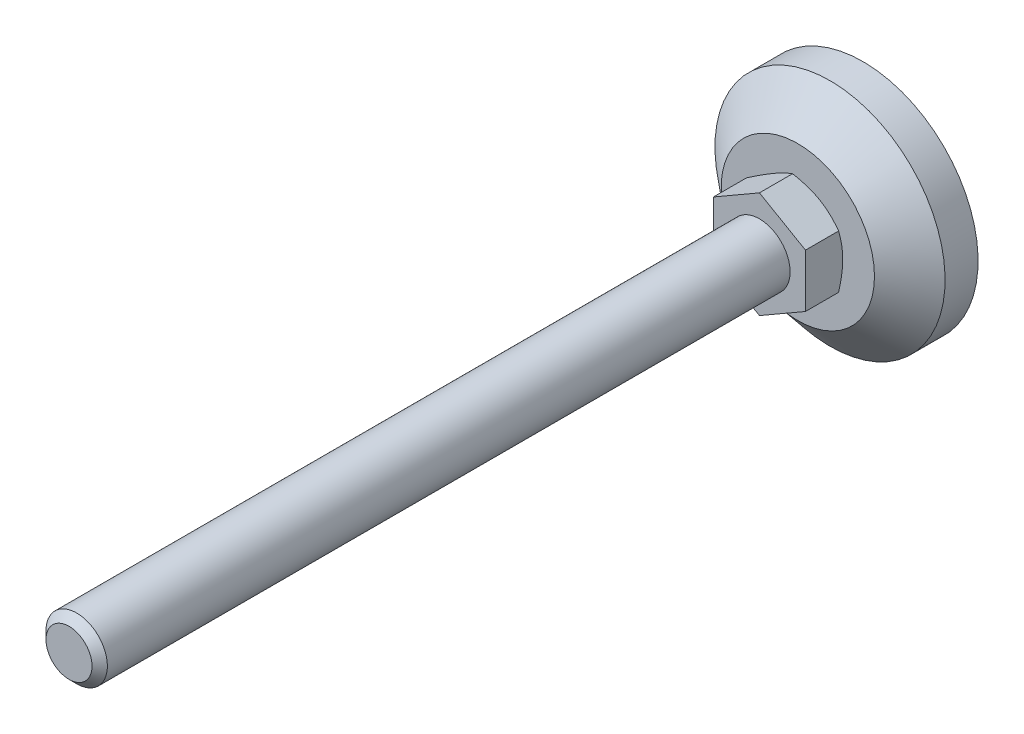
ISO-10303-21;
HEADER;
FILE_DESCRIPTION(('STEP AP214'),'2;1');
FILE_NAME('part.step','',(''),(''),'','','');
FILE_SCHEMA(('AUTOMOTIVE_DESIGN { 1 0 10303 214 1 1 1 1 }'));
ENDSEC;
DATA;
#1=APPLICATION_CONTEXT('core data for automotive mechanical design processes');
#2=APPLICATION_PROTOCOL_DEFINITION('international standard','automotive_design',2000,#1);
#3=PRODUCT_CONTEXT('',#1,'mechanical');
#4=PRODUCT('Part','Part','',(#3));
#5=PRODUCT_RELATED_PRODUCT_CATEGORY('part','',(#4));
#6=PRODUCT_DEFINITION_FORMATION('','',#4);
#7=PRODUCT_DEFINITION_CONTEXT('part definition',#1,'design');
#8=PRODUCT_DEFINITION('design','',#6,#7);
#9=PRODUCT_DEFINITION_SHAPE('','',#8);
#10=(LENGTH_UNIT() NAMED_UNIT(*) SI_UNIT(.MILLI.,.METRE.));
#11=(NAMED_UNIT(*) PLANE_ANGLE_UNIT() SI_UNIT($,.RADIAN.));
#12=(NAMED_UNIT(*) SI_UNIT($,.STERADIAN.) SOLID_ANGLE_UNIT());
#13=UNCERTAINTY_MEASURE_WITH_UNIT(LENGTH_MEASURE(1.E-05),#10,'distance_accuracy_value','');
#14=(GEOMETRIC_REPRESENTATION_CONTEXT(3) GLOBAL_UNCERTAINTY_ASSIGNED_CONTEXT((#13)) GLOBAL_UNIT_ASSIGNED_CONTEXT((#10,
#11,#12)) REPRESENTATION_CONTEXT('',''));
#15=CARTESIAN_POINT('',(0.,0.,0.));
#16=DIRECTION('',(0.,0.,1.));
#17=DIRECTION('',(1.,0.,0.));
#18=AXIS2_PLACEMENT_3D('',#15,#16,#17);
#19=CARTESIAN_POINT('',(0.,0.,27.));
#20=DIRECTION('',(0.,0.,1.));
#21=DIRECTION('',(0.5,-0.866025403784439,0.));
#22=AXIS2_PLACEMENT_3D('',#19,#20,#21);
#23=PLANE('',#22);
#24=DIRECTION('',(0.,1.,0.));
#25=VECTOR('',#24,1.);
#26=CARTESIAN_POINT('',(12.,-6.92820323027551,27.));
#27=LINE('',#26,#25);
#28=CARTESIAN_POINT('',(12.,-6.92820323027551,27.));
#29=VERTEX_POINT('',#28);
#30=CARTESIAN_POINT('',(12.,6.92820323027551,27.));
#31=VERTEX_POINT('',#30);
#32=EDGE_CURVE('E197',#29,#31,#27,.T.);
#33=ORIENTED_EDGE('',*,*,#32,.T.);
#34=DIRECTION('',(-0.866025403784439,0.5,0.));
#35=VECTOR('',#34,1.);
#36=CARTESIAN_POINT('',(12.,6.92820323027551,27.));
#37=LINE('',#36,#35);
#38=CARTESIAN_POINT('',(0.,13.856406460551,27.));
#39=VERTEX_POINT('',#38);
#40=EDGE_CURVE('E320',#31,#39,#37,.T.);
#41=ORIENTED_EDGE('',*,*,#40,.T.);
#42=DIRECTION('',(-0.866025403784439,-0.5,0.));
#43=VECTOR('',#42,1.);
#44=CARTESIAN_POINT('',(0.,13.856406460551,27.));
#45=LINE('',#44,#43);
#46=CARTESIAN_POINT('',(-12.,6.92820323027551,27.));
#47=VERTEX_POINT('',#46);
#48=EDGE_CURVE('E319',#39,#47,#45,.T.);
#49=ORIENTED_EDGE('',*,*,#48,.T.);
#50=DIRECTION('',(0.,-1.,0.));
#51=VECTOR('',#50,1.);
#52=CARTESIAN_POINT('',(-12.,6.92820323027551,27.));
#53=LINE('',#52,#51);
#54=CARTESIAN_POINT('',(-12.,-6.92820323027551,27.));
#55=VERTEX_POINT('',#54);
#56=EDGE_CURVE('E324',#47,#55,#53,.T.);
#57=ORIENTED_EDGE('',*,*,#56,.T.);
#58=DIRECTION('',(0.866025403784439,-0.5,0.));
#59=VECTOR('',#58,1.);
#60=CARTESIAN_POINT('',(-12.,-6.92820323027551,27.));
#61=LINE('',#60,#59);
#62=CARTESIAN_POINT('',(0.,-13.856406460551,27.));
#63=VERTEX_POINT('',#62);
#64=EDGE_CURVE('E326',#55,#63,#61,.T.);
#65=ORIENTED_EDGE('',*,*,#64,.T.);
#66=DIRECTION('',(0.866025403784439,0.5,0.));
#67=VECTOR('',#66,1.);
#68=CARTESIAN_POINT('',(0.,-13.856406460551,27.));
#69=LINE('',#68,#67);
#70=EDGE_CURVE('E37',#63,#29,#69,.T.);
#71=ORIENTED_EDGE('',*,*,#70,.T.);
#72=EDGE_LOOP('',(#33,#41,#49,#57,#65,#71));
#73=FACE_BOUND('',#72,.T.);
#74=CARTESIAN_POINT('',(0.,0.,27.));
#75=DIRECTION('',(0.,0.,1.));
#76=DIRECTION('',(0.5,-0.866025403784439,0.));
#77=AXIS2_PLACEMENT_3D('',#74,#75,#76);
#78=CIRCLE('',#77,8.);
#79=CARTESIAN_POINT('',(4.,-6.92820323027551,27.));
#80=VERTEX_POINT('',#79);
#81=EDGE_CURVE('E201',#80,#80,#78,.T.);
#82=ORIENTED_EDGE('',*,*,#81,.F.);
#83=EDGE_LOOP('',(#82));
#84=FACE_BOUND('',#83,.T.);
#85=ADVANCED_FACE('F14',(#73,#84),#23,.T.);
#86=CARTESIAN_POINT('',(-9.99463491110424,17.3112154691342,17.));
#87=DIRECTION('',(0.,0.,1.));
#88=DIRECTION('',(0.5,-0.866025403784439,0.));
#89=AXIS2_PLACEMENT_3D('',#86,#87,#88);
#90=PLANE('',#89);
#91=CARTESIAN_POINT('',(0.,0.,17.));
#92=DIRECTION('',(0.,0.,-1.));
#93=DIRECTION('',(-0.5,0.866025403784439,0.));
#94=AXIS2_PLACEMENT_3D('',#91,#92,#93);
#95=CIRCLE('',#94,19.9892698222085);
#96=CARTESIAN_POINT('',(-9.99463491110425,17.3112154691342,17.));
#97=VERTEX_POINT('',#96);
#98=EDGE_CURVE('E102',#97,#97,#95,.T.);
#99=ORIENTED_EDGE('',*,*,#98,.F.);
#100=EDGE_LOOP('',(#99));
#101=FACE_BOUND('',#100,.T.);
#102=CARTESIAN_POINT('',(0.,0.,17.));
#103=DIRECTION('',(0.,0.,-1.));
#104=DIRECTION('',(-0.5,0.866025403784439,0.));
#105=AXIS2_PLACEMENT_3D('',#102,#103,#104);
#106=CIRCLE('',#105,11.5);
#107=CARTESIAN_POINT('',(-5.75,9.95929214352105,17.));
#108=VERTEX_POINT('',#107);
#109=EDGE_CURVE('E84',#108,#108,#106,.T.);
#110=ORIENTED_EDGE('',*,*,#109,.T.);
#111=EDGE_LOOP('',(#110));
#112=FACE_BOUND('',#111,.T.);
#113=ADVANCED_FACE('F174',(#101,#112),#90,.T.);
#114=CARTESIAN_POINT('',(0.,0.,0.));
#115=DIRECTION('',(0.,0.,-1.));
#116=DIRECTION('',(-0.5,0.866025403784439,0.));
#117=AXIS2_PLACEMENT_3D('',#114,#115,#116);
#118=PLANE('',#117);
#119=CARTESIAN_POINT('',(0.,0.,0.));
#120=DIRECTION('',(0.,0.,-1.));
#121=DIRECTION('',(-0.5,0.866025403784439,0.));
#122=AXIS2_PLACEMENT_3D('',#119,#120,#121);
#123=CIRCLE('',#122,30.);
#124=CARTESIAN_POINT('',(-15.,25.9807621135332,0.));
#125=VERTEX_POINT('',#124);
#126=EDGE_CURVE('E73',#125,#125,#123,.T.);
#127=ORIENTED_EDGE('',*,*,#126,.T.);
#128=EDGE_LOOP('',(#127));
#129=FACE_BOUND('',#128,.T.);
#130=ADVANCED_FACE('F177',(#129),#118,.T.);
#131=CARTESIAN_POINT('',(0.,0.,-75.4972525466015));
#132=DIRECTION('',(0.,0.,-1.));
#133=DIRECTION('',(-0.5,0.866025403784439,0.));
#134=AXIS2_PLACEMENT_3D('',#131,#132,#133);
#135=CYLINDRICAL_SURFACE('',#134,30.);
#136=CARTESIAN_POINT('',(0.,0.,8.6));
#137=DIRECTION('',(0.,0.,-1.));
#138=DIRECTION('',(-0.5,0.866025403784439,0.));
#139=AXIS2_PLACEMENT_3D('',#136,#137,#138);
#140=CIRCLE('',#139,30.);
#141=CARTESIAN_POINT('',(-15.,25.9807621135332,8.6));
#142=VERTEX_POINT('',#141);
#143=EDGE_CURVE('E105',#142,#142,#140,.T.);
#144=ORIENTED_EDGE('',*,*,#143,.T.);
#145=EDGE_LOOP('',(#144));
#146=FACE_BOUND('',#145,.T.);
#147=ORIENTED_EDGE('',*,*,#126,.F.);
#148=EDGE_LOOP('',(#147));
#149=FACE_BOUND('',#148,.T.);
#150=ADVANCED_FACE('F181',(#146,#149),#135,.T.);
#151=CARTESIAN_POINT('',(0.,0.,8.6));
#152=DIRECTION('',(0.,0.,-1.));
#153=DIRECTION('',(-0.5,0.866025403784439,0.));
#154=AXIS2_PLACEMENT_3D('',#151,#152,#153);
#155=CONICAL_SURFACE('',#154,30.,0.872664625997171);
#156=ORIENTED_EDGE('',*,*,#98,.T.);
#157=EDGE_LOOP('',(#156));
#158=FACE_BOUND('',#157,.T.);
#159=ORIENTED_EDGE('',*,*,#143,.F.);
#160=EDGE_LOOP('',(#159));
#161=FACE_BOUND('',#160,.T.);
#162=ADVANCED_FACE('F121',(#158,#161),#155,.T.);
#163=CARTESIAN_POINT('',(0.,0.,20.8975219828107));
#164=DIRECTION('',(0.,0.,1.));
#165=DIRECTION('',(0.5,-0.866025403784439,0.));
#166=AXIS2_PLACEMENT_3D('',#163,#164,#165);
#167=CONICAL_SURFACE('',#166,18.2507060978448,1.0471975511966);
#168=ORIENTED_EDGE('',*,*,#109,.F.);
#169=EDGE_LOOP('',(#168));
#170=FACE_BOUND('',#169,.T.);
#171=CARTESIAN_POINT('',(-10.1845483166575,-19.7364581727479,23.1830146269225));
#172=CARTESIAN_POINT('',(-9.95731802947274,-19.6052667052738,23.0555465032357));
#173=CARTESIAN_POINT('',(-9.72982292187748,-19.4739223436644,22.9287081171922));
#174=CARTESIAN_POINT('',(-9.27424782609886,-19.2108959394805,22.6764332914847));
#175=CARTESIAN_POINT('',(-9.04616783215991,-19.0792138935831,22.5509968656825));
#176=CARTESIAN_POINT('',(-8.360907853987,-18.6835788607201,22.1769716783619));
#177=CARTESIAN_POINT('',(-7.90277404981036,-18.4190751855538,21.930704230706));
#178=CARTESIAN_POINT('',(-6.98100239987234,-17.8868900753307,21.4445247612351));
#179=CARTESIAN_POINT('',(-6.51734820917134,-17.6191992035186,21.2046539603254));
#180=CARTESIAN_POINT('',(-5.58637620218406,-17.0817022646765,20.734620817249));
#181=CARTESIAN_POINT('',(-5.11905855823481,-16.8118962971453,20.5044580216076));
#182=CARTESIAN_POINT('',(-4.16467967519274,-16.2608853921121,20.0490896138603));
#183=CARTESIAN_POINT('',(-3.67747196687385,-15.9795958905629,19.82429119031));
#184=CARTESIAN_POINT('',(-2.69737824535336,-15.413738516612,19.3915182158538));
#185=CARTESIAN_POINT('',(-2.20449160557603,-15.1291702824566,19.1835455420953));
#186=CARTESIAN_POINT('',(-1.21317256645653,-14.5568319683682,18.7898295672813));
#187=CARTESIAN_POINT('',(-0.714753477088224,-14.2690695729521,18.6040419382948));
#188=CARTESIAN_POINT('',(0.289281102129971,-13.6893899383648,18.2605950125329));
#189=CARTESIAN_POINT('',(0.794894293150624,-13.3974740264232,18.1029269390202));
#190=CARTESIAN_POINT('',(1.55740346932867,-12.9572391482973,17.8936125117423));
#191=CARTESIAN_POINT('',(1.81154649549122,-12.8105096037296,17.82851512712));
#192=CARTESIAN_POINT('',(2.3215816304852,-12.5160406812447,17.7081511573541));
#193=CARTESIAN_POINT('',(2.57747370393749,-12.3683013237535,17.652884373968));
#194=CARTESIAN_POINT('',(3.09083535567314,-12.0719118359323,17.5531523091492));
#195=CARTESIAN_POINT('',(3.34830490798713,-11.9232617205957,17.5086868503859));
#196=CARTESIAN_POINT('',(3.86455433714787,-11.6252049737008,17.4314414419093));
#197=CARTESIAN_POINT('',(4.12333416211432,-11.4757983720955,17.3986610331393));
#198=CARTESIAN_POINT('',(4.63843364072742,-11.1784055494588,17.345852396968));
#199=CARTESIAN_POINT('',(4.89474072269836,-11.0304265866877,17.3256616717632));
#200=CARTESIAN_POINT('',(5.40786438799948,-10.7341745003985,17.2978182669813));
#201=CARTESIAN_POINT('',(5.66468096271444,-10.5859013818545,17.2901653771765));
#202=CARTESIAN_POINT('',(6.17836497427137,-10.2893257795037,17.287579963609));
#203=CARTESIAN_POINT('',(6.43523241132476,-10.1410232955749,17.2926474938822));
#204=CARTESIAN_POINT('',(6.94855188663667,-9.84465815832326,17.3153783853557));
#205=CARTESIAN_POINT('',(7.20500390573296,-9.69659551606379,17.3330423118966));
#206=CARTESIAN_POINT('',(7.81927447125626,-9.34194623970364,17.3900614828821));
#207=CARTESIAN_POINT('',(8.17669346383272,-9.13559028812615,17.4352607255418));
#208=CARTESIAN_POINT('',(8.88892563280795,-8.72438285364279,17.5476838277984));
#209=CARTESIAN_POINT('',(9.24373845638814,-8.51953157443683,17.6149106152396));
#210=CARTESIAN_POINT('',(9.95040329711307,-8.11153843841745,17.7689975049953));
#211=CARTESIAN_POINT('',(10.3022528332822,-7.90839801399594,17.8558726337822));
#212=CARTESIAN_POINT('',(11.0024455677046,-7.50414155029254,18.0466010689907));
#213=CARTESIAN_POINT('',(11.3507888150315,-7.30302548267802,18.1504541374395));
#214=CARTESIAN_POINT('',(12.0517118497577,-6.89834737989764,18.3750877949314));
#215=CARTESIAN_POINT('',(12.4042127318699,-6.69483090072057,18.4961943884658));
#216=CARTESIAN_POINT('',(13.1057427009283,-6.28980238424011,18.7510771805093));
#217=CARTESIAN_POINT('',(13.4547717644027,-6.08829036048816,18.8848534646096));
#218=CARTESIAN_POINT('',(14.1495287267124,-5.68717224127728,19.1629377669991));
#219=CARTESIAN_POINT('',(14.4952576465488,-5.48756555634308,19.3072424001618));
#220=CARTESIAN_POINT('',(15.1838410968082,-5.09001171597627,19.6046702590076));
#221=CARTESIAN_POINT('',(15.5266956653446,-4.89206453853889,19.7577933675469));
#222=CARTESIAN_POINT('',(16.3531119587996,-4.41493286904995,20.1371587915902));
#223=CARTESIAN_POINT('',(16.8353860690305,-4.13649178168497,20.3671360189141));
#224=CARTESIAN_POINT('',(17.7956874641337,-3.58206151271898,20.838658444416));
#225=CARTESIAN_POINT('',(18.2737144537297,-3.3060725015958,21.0802044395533));
#226=CARTESIAN_POINT('',(19.2263411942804,-2.75607319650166,21.572480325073));
#227=CARTESIAN_POINT('',(19.7009400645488,-2.48206341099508,21.8232124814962));
#228=CARTESIAN_POINT('',(20.647182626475,-1.93575001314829,22.3319518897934));
#229=CARTESIAN_POINT('',(21.1188263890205,-1.66344635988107,22.5899589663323));
#230=CARTESIAN_POINT('',(22.060219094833,-1.11993302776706,23.1121588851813));
#231=CARTESIAN_POINT('',(22.5299651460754,-0.848725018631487,23.3763586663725));
#232=CARTESIAN_POINT('',(23.4674052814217,-0.307493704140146,23.9095679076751));
#233=CARTESIAN_POINT('',(23.9350993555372,-0.037470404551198,24.1785773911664));
#234=CARTESIAN_POINT('',(24.8686924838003,0.50153983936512,24.7205226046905));
#235=CARTESIAN_POINT('',(25.3345917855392,0.770526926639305,24.9934577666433));
#236=CARTESIAN_POINT('',(26.2649273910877,1.30765643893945,25.5426344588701));
#237=CARTESIAN_POINT('',(26.7293636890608,1.57579886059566,25.8188760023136));
#238=CARTESIAN_POINT('',(28.0397530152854,2.33235249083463,26.6032315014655));
#239=CARTESIAN_POINT('',(28.8842584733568,2.81992794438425,27.1145698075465));
#240=CARTESIAN_POINT('',(30.5701660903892,3.79328716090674,28.1440983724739));
#241=CARTESIAN_POINT('',(31.4115681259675,4.27907085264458,28.6622889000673));
#242=CARTESIAN_POINT('',(33.0897202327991,5.24795242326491,29.7025139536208));
#243=CARTESIAN_POINT('',(33.9264767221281,5.73105400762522,30.2245346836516));
#244=CARTESIAN_POINT('',(35.1801565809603,6.45486641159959,31.0105887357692));
#245=CARTESIAN_POINT('',(35.5977953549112,6.69599027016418,31.2731029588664));
#246=CARTESIAN_POINT('',(36.4326440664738,7.17799039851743,31.7990373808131));
#247=CARTESIAN_POINT('',(36.8498540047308,7.41886666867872,32.0624575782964));
#248=CARTESIAN_POINT('',(37.2668741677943,7.65963337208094,32.3262778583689));
#249=B_SPLINE_CURVE_WITH_KNOTS('',3,(#171,#172,#173,#174,#175,#176,#177,#178,#179,#180,#181,
#182,#183,#184,#185,#186,#187,#188,#189,#190,#191,#192,#193,#194,#195,#196,#197,#198,#199,#200,
#201,#202,#203,#204,#205,#206,#207,#208,#209,#210,#211,#212,#213,#214,#215,#216,#217,#218,#219,
#220,#221,#222,#223,#224,#225,#226,#227,#228,#229,#230,#231,#232,#233,#234,#235,#236,#237,#238,
#239,#240,#241,#242,#243,#244,#245,#246,#247,#248),.UNSPECIFIED.,.F.,.F.,(4,2,2,2,2,2,2,2,2,2,2,
2,2,2,2,2,2,2,2,2,2,2,2,2,2,2,2,2,2,2,2,2,2,2,2,2,2,2,4),(0.,0.875119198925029,1.75024704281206,
3.50075771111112,5.26066680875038,7.02049360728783,8.8377767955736,10.6552624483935,
12.469053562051,14.2822775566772,15.1839173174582,16.085538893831,16.9871456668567,
17.8887170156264,18.7783966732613,19.6680614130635,20.5577299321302,21.4474383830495,
22.6922901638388,23.9373074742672,25.1832801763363,26.4292354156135,27.7029922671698,
28.9767577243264,30.2501154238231,31.5234562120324,33.3307782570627,35.1382249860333,
36.9461206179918,38.7539727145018,40.5639577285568,42.3739515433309,44.1836860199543,
45.9934277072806,49.2966384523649,52.5999791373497,55.8945808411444,57.5417866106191,
59.1889898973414),.UNSPECIFIED.);
#250=CARTESIAN_POINT('',(0.,-13.856406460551,18.3604719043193));
#251=VERTEX_POINT('',#250);
#252=CARTESIAN_POINT('',(12.,-6.92820323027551,18.3604719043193));
#253=VERTEX_POINT('',#252);
#254=EDGE_CURVE('E65',#251,#253,#249,.T.);
#255=ORIENTED_EDGE('',*,*,#254,.F.);
#256=CARTESIAN_POINT('',(-12.0002,-6.92808776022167,18.3605385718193));
#257=CARTESIAN_POINT('',(-11.7364142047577,-7.08038456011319,18.2726247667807));
#258=CARTESIAN_POINT('',(-11.4716448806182,-7.2332492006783,18.1887011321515));
#259=CARTESIAN_POINT('',(-10.9399829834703,-7.54020434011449,18.0299413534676));
#260=CARTESIAN_POINT('',(-10.6730897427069,-7.69429522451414,17.9551081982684));
#261=CARTESIAN_POINT('',(-9.86810959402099,-8.15905073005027,17.7456926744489));
#262=CARTESIAN_POINT('',(-9.3268449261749,-8.47155003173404,17.6265783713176));
#263=CARTESIAN_POINT('',(-8.51686717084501,-8.93919090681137,17.4869061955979));
#264=CARTESIAN_POINT('',(-8.25057389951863,-9.09293539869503,17.4471189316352));
#265=CARTESIAN_POINT('',(-7.71675440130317,-9.40113622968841,17.3803985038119));
#266=CARTESIAN_POINT('',(-7.44922815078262,-9.55559258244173,17.3534655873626));
#267=CARTESIAN_POINT('',(-6.91372963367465,-9.86476279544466,17.3131437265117));
#268=CARTESIAN_POINT('',(-6.64575827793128,-10.0194761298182,17.2997386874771));
#269=CARTESIAN_POINT('',(-6.10956726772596,-10.3290461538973,17.286758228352));
#270=CARTESIAN_POINT('',(-5.84134762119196,-10.4839028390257,17.2871823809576));
#271=CARTESIAN_POINT('',(-5.33991062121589,-10.7734076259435,17.3008951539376));
#272=CARTESIAN_POINT('',(-5.10665750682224,-10.908076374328,17.3125111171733));
#273=CARTESIAN_POINT('',(-4.64068775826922,-11.1771041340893,17.3459831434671));
#274=CARTESIAN_POINT('',(-4.40797116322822,-11.3114631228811,17.367839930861));
#275=CARTESIAN_POINT('',(-3.94320092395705,-11.5797983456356,17.4214125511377));
#276=CARTESIAN_POINT('',(-3.71114798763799,-11.7137741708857,17.4531365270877));
#277=CARTESIAN_POINT('',(-3.24813003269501,-11.9810977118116,17.5258869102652));
#278=CARTESIAN_POINT('',(-3.01716508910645,-12.1144453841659,17.566913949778));
#279=CARTESIAN_POINT('',(-2.31605804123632,-12.5192297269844,17.7049867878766));
#280=CARTESIAN_POINT('',(-1.84794625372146,-12.789494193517,17.8158000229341));
#281=CARTESIAN_POINT('',(-0.918702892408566,-13.3259930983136,18.0673009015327));
#282=CARTESIAN_POINT('',(-0.457559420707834,-13.5922344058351,18.2079294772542));
#283=CARTESIAN_POINT('',(0.000200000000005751,-13.8565219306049,18.3605385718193));
#284=B_SPLINE_CURVE_WITH_KNOTS('',3,(#256,#257,#258,#259,#260,#261,#262,#263,#264,#265,#266,
#267,#268,#269,#270,#271,#272,#273,#274,#275,#276,#277,#278,#279,#280,#281,#282,#283),
.UNSPECIFIED.,.F.,.F.,(4,2,2,2,2,2,2,2,2,2,2,2,2,4),(0.,0.951004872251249,1.90232158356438,
3.80900466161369,4.73894551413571,5.6689042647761,6.59775529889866,7.52657763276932,
8.3351464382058,9.14377244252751,9.95306755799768,10.7624176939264,12.4167102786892,
14.0677556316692),.UNSPECIFIED.);
#285=CARTESIAN_POINT('',(-12.,-6.92820323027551,18.3604719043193));
#286=VERTEX_POINT('',#285);
#287=EDGE_CURVE('E68',#286,#251,#284,.T.);
#288=ORIENTED_EDGE('',*,*,#287,.F.);
#289=CARTESIAN_POINT('',(-12.,6.92843417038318,18.3605385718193));
#290=CARTESIAN_POINT('',(-12.,6.62384057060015,18.2726247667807));
#291=CARTESIAN_POINT('',(-12.,6.31811128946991,18.1887011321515));
#292=CARTESIAN_POINT('',(-12.,5.70420101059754,18.0299413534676));
#293=CARTESIAN_POINT('',(-12.,5.39601924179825,17.9551081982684));
#294=CARTESIAN_POINT('',(-12.,4.46650823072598,17.7456926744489));
#295=CARTESIAN_POINT('',(-12.,3.84150962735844,17.6265783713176));
#296=CARTESIAN_POINT('',(-12.,2.90622787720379,17.4869061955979));
#297=CARTESIAN_POINT('',(-12.,2.59873889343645,17.4471189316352));
#298=CARTESIAN_POINT('',(-12.,1.98233723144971,17.3803985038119));
#299=CARTESIAN_POINT('',(-12.,1.67342452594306,17.3534655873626));
#300=CARTESIAN_POINT('',(-12.,1.05508409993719,17.3131437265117));
#301=CARTESIAN_POINT('',(-12.,0.745657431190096,17.2997386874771));
#302=CARTESIAN_POINT('',(-12.,0.126517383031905,17.286758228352));
#303=CARTESIAN_POINT('',(-12.,-0.183195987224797,17.2871823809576));
#304=CARTESIAN_POINT('',(-12.,-0.76220556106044,17.3008951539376));
#305=CARTESIAN_POINT('',(-12.,-1.03154305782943,17.3125111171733));
#306=CARTESIAN_POINT('',(-12.,-1.56959857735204,17.3459831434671));
#307=CARTESIAN_POINT('',(-12.,-1.83831655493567,17.367839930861));
#308=CARTESIAN_POINT('',(-12.,-2.37498700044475,17.4214125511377));
#309=CARTESIAN_POINT('',(-12.,-2.64293865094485,17.4531365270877));
#310=CARTESIAN_POINT('',(-12.,-3.17758573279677,17.5258869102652));
#311=CARTESIAN_POINT('',(-12.,-3.44428107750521,17.566913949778));
#312=CARTESIAN_POINT('',(-12.,-4.25384976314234,17.7049867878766));
#313=CARTESIAN_POINT('',(-12.,-4.79437869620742,17.8158000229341));
#314=CARTESIAN_POINT('',(-12.,-5.86737650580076,18.0673009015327));
#315=CARTESIAN_POINT('',(-12.,-6.39985912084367,18.2079294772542));
#316=CARTESIAN_POINT('',(-12.,-6.92843417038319,18.3605385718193));
#317=B_SPLINE_CURVE_WITH_KNOTS('',3,(#289,#290,#291,#292,#293,#294,#295,#296,#297,#298,#299,
#300,#301,#302,#303,#304,#305,#306,#307,#308,#309,#310,#311,#312,#313,#314,#315,#316),
.UNSPECIFIED.,.F.,.F.,(4,2,2,2,2,2,2,2,2,2,2,2,2,4),(0.,0.951004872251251,1.90232158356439,
3.80900466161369,4.73894551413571,5.6689042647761,6.59775529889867,7.52657763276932,
8.3351464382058,9.14377244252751,9.95306755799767,10.7624176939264,12.4167102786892,
14.0677556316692),.UNSPECIFIED.);
#318=CARTESIAN_POINT('',(-12.,6.92820323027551,18.3604719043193));
#319=VERTEX_POINT('',#318);
#320=EDGE_CURVE('E83',#319,#286,#317,.T.);
#321=ORIENTED_EDGE('',*,*,#320,.F.);
#322=CARTESIAN_POINT('',(-22.184548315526,1.04815151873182,23.1830146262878));
#323=CARTESIAN_POINT('',(-21.9573180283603,1.179342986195,23.0555465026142));
#324=CARTESIAN_POINT('',(-21.729822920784,1.31068734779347,22.9287081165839));
#325=CARTESIAN_POINT('',(-21.2742478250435,1.57371375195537,22.676433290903));
#326=CARTESIAN_POINT('',(-21.0461678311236,1.7053957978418,22.550996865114));
#327=CARTESIAN_POINT('',(-20.3609078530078,2.1010308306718,22.1769716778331));
#328=CARTESIAN_POINT('',(-19.9027740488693,2.36553450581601,21.9307042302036));
#329=CARTESIAN_POINT('',(-18.9810023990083,2.89771961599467,21.4445247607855));
#330=CARTESIAN_POINT('',(-18.517348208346,3.16541048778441,21.2046539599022));
#331=CARTESIAN_POINT('',(-17.5863762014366,3.7029074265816,20.7346208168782));
#332=CARTESIAN_POINT('',(-17.1190585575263,3.97271339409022,20.5044580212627));
#333=CARTESIAN_POINT('',(-16.1646796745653,4.52372429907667,20.0490896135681));
#334=CARTESIAN_POINT('',(-15.6774719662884,4.80501380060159,19.8242911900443));
#335=CARTESIAN_POINT('',(-14.6973782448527,5.37087117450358,19.3915182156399));
#336=CARTESIAN_POINT('',(-14.2044916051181,5.65543940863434,19.1835455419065));
#337=CARTESIAN_POINT('',(-13.2131725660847,6.22777772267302,18.7898295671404));
#338=CARTESIAN_POINT('',(-12.7147534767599,6.51554011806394,18.6040419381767));
#339=CARTESIAN_POINT('',(-11.7107188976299,7.09521975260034,18.2605950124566));
#340=CARTESIAN_POINT('',(-11.2051057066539,7.38713566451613,18.1029269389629));
#341=CARTESIAN_POINT('',(-10.4425965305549,7.82737054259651,17.8936125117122));
#342=CARTESIAN_POINT('',(-10.1884535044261,7.97410008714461,17.8285151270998));
#343=CARTESIAN_POINT('',(-9.67841836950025,8.26856900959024,17.7081511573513));
#344=CARTESIAN_POINT('',(-9.42252629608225,8.41630836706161,17.6528843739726));
#345=CARTESIAN_POINT('',(-8.90916464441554,8.71269785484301,17.5531523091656));
#346=CARTESIAN_POINT('',(-8.6516950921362,8.86134797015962,17.5086868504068));
#347=CARTESIAN_POINT('',(-8.13544566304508,9.15940471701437,17.4314414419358));
#348=CARTESIAN_POINT('',(-7.87666583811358,9.30881131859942,17.3986610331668));
#349=CARTESIAN_POINT('',(-7.36156635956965,9.60620414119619,17.3458523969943));
#350=CARTESIAN_POINT('',(-7.10525927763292,9.75418310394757,17.3256616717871));
#351=CARTESIAN_POINT('',(-6.59213561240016,10.0504351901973,17.2978182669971));
#352=CARTESIAN_POINT('',(-6.33531903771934,10.1987083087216,17.2901653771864));
#353=CARTESIAN_POINT('',(-5.82163502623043,10.4952839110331,17.2875799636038));
#354=CARTESIAN_POINT('',(-5.56476758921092,10.6435863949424,17.2926474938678));
#355=CARTESIAN_POINT('',(-5.05144811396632,10.9399515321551,17.3153783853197));
#356=CARTESIAN_POINT('',(-4.79499609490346,11.0880141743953,17.3330423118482));
#357=CARTESIAN_POINT('',(-4.18072552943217,11.4426634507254,17.3900614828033));
#358=CARTESIAN_POINT('',(-3.82330653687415,11.6490194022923,17.4352607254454));
#359=CARTESIAN_POINT('',(-3.11107436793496,12.0602268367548,17.547683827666));
#360=CARTESIAN_POINT('',(-2.75626154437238,12.2650781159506,17.6149106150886));
#361=CARTESIAN_POINT('',(-2.04959670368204,12.67307125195,17.768997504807));
#362=CARTESIAN_POINT('',(-1.69774716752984,12.8762116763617,17.8558726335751));
#363=CARTESIAN_POINT('',(-0.997554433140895,13.2804681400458,18.0466010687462));
#364=CARTESIAN_POINT('',(-0.649211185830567,13.4815842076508,18.1504541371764));
#365=CARTESIAN_POINT('',(0.0517118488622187,13.8862623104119,18.3750877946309));
#366=CARTESIAN_POINT('',(0.404212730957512,14.0897787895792,18.4961943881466));
#367=CARTESIAN_POINT('',(1.10574269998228,14.4948073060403,18.7510771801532));
#368=CARTESIAN_POINT('',(1.45477176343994,14.6963193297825,18.8848534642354));
#369=CARTESIAN_POINT('',(2.1495287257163,15.0974374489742,19.1629377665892));
#370=CARTESIAN_POINT('',(2.49525764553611,15.2970441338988,19.3072423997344));
#371=CARTESIAN_POINT('',(3.18384109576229,15.6945979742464,19.6046702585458));
#372=CARTESIAN_POINT('',(3.52669566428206,15.8925451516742,19.7577933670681));
#373=CARTESIAN_POINT('',(4.3531119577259,16.3696768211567,20.1371587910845));
#374=CARTESIAN_POINT('',(4.83538606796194,16.6481179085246,20.3671360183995));
#375=CARTESIAN_POINT('',(5.7956874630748,17.2025481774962,20.838658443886));
#376=CARTESIAN_POINT('',(6.27371445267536,17.478537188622,21.0802044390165));
#377=CARTESIAN_POINT('',(7.22634119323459,18.0285364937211,21.5724803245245));
#378=CARTESIAN_POINT('',(7.7009400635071,18.30254627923,21.8232124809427));
#379=CARTESIAN_POINT('',(8.64718262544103,18.8488596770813,22.3319518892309));
#380=CARTESIAN_POINT('',(9.11882638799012,19.1211633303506,22.589958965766));
#381=CARTESIAN_POINT('',(10.0602190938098,19.6646766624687,23.1121588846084));
#382=CARTESIAN_POINT('',(10.5299651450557,19.9358846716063,23.3763586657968));
#383=CARTESIAN_POINT('',(11.4674052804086,20.4771159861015,23.9095679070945));
#384=CARTESIAN_POINT('',(11.9350993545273,20.7471392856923,24.1785773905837));
#385=CARTESIAN_POINT('',(12.8686924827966,21.2861495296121,24.7205226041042));
#386=CARTESIAN_POINT('',(13.3345917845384,21.555136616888,24.9934577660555));
#387=CARTESIAN_POINT('',(14.2649273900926,22.0922661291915,25.5426344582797));
#388=CARTESIAN_POINT('',(14.7293636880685,22.3604085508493,25.8188760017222));
#389=CARTESIAN_POINT('',(16.0397530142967,23.1169621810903,26.6032315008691));
#390=CARTESIAN_POINT('',(16.8842584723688,23.6045376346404,27.1145698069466));
#391=CARTESIAN_POINT('',(18.5701660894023,24.5778968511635,28.1440983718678));
#392=CARTESIAN_POINT('',(19.411568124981,25.0636805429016,28.6622888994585));
#393=CARTESIAN_POINT('',(21.0897202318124,26.0325621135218,29.7025139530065));
#394=CARTESIAN_POINT('',(21.9264767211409,26.5156636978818,30.2245346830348));
#395=CARTESIAN_POINT('',(23.1801565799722,27.2394761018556,31.0105887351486));
#396=CARTESIAN_POINT('',(23.5977953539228,27.48059996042,31.2731029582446));
#397=CARTESIAN_POINT('',(24.4326440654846,27.9626000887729,31.799037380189));
#398=CARTESIAN_POINT('',(24.8498540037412,28.2034763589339,32.0624575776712));
#399=CARTESIAN_POINT('',(25.2668741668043,28.4442430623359,32.3262778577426));
#400=B_SPLINE_CURVE_WITH_KNOTS('',3,(#322,#323,#324,#325,#326,#327,#328,#329,#330,#331,#332,
#333,#334,#335,#336,#337,#338,#339,#340,#341,#342,#343,#344,#345,#346,#347,#348,#349,#350,#351,
#352,#353,#354,#355,#356,#357,#358,#359,#360,#361,#362,#363,#364,#365,#366,#367,#368,#369,#370,
#371,#372,#373,#374,#375,#376,#377,#378,#379,#380,#381,#382,#383,#384,#385,#386,#387,#388,#389,
#390,#391,#392,#393,#394,#395,#396,#397,#398,#399),.UNSPECIFIED.,.F.,.F.,(4,2,2,2,2,2,2,2,2,2,2,
2,2,2,2,2,2,2,2,2,2,2,2,2,2,2,2,2,2,2,2,2,2,2,2,2,2,2,4),(0.,0.875119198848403,1.7502470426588,
3.50075771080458,5.2606668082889,7.02049360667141,8.83777679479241,10.6552624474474,
12.4690535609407,14.2822775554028,15.183917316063,16.085538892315,16.9871456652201,
17.8887170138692,18.7783966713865,19.668061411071,20.55772993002,21.4474383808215,
22.6922901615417,23.9373074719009,25.1832801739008,26.4292354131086,27.7029922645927,
28.9767577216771,30.2501154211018,31.523456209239,33.3307782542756,35.1382249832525,
36.9461206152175,38.7539727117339,40.5639577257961,42.3739515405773,44.1836860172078,
45.9934277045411,49.2966384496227,52.5999791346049,55.8945808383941,57.541786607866,
59.1889898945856),.UNSPECIFIED.);
#401=CARTESIAN_POINT('',(0.,13.856406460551,18.3604719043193));
#402=VERTEX_POINT('',#401);
#403=EDGE_CURVE('E143',#402,#319,#400,.F.);
#404=ORIENTED_EDGE('',*,*,#403,.F.);
#405=CARTESIAN_POINT('',(12.0002,6.92808776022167,18.3605385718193));
#406=CARTESIAN_POINT('',(11.7364142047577,7.08038456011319,18.2726247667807));
#407=CARTESIAN_POINT('',(11.4716448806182,7.2332492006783,18.1887011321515));
#408=CARTESIAN_POINT('',(10.9399829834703,7.54020434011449,18.0299413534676));
#409=CARTESIAN_POINT('',(10.6730897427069,7.69429522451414,17.9551081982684));
#410=CARTESIAN_POINT('',(9.86810959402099,8.15905073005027,17.7456926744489));
#411=CARTESIAN_POINT('',(9.3268449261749,8.47155003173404,17.6265783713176));
#412=CARTESIAN_POINT('',(8.51686717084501,8.93919090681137,17.4869061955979));
#413=CARTESIAN_POINT('',(8.25057389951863,9.09293539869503,17.4471189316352));
#414=CARTESIAN_POINT('',(7.71675440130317,9.40113622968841,17.3803985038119));
#415=CARTESIAN_POINT('',(7.44922815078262,9.55559258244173,17.3534655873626));
#416=CARTESIAN_POINT('',(6.91372963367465,9.86476279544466,17.3131437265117));
#417=CARTESIAN_POINT('',(6.64575827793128,10.0194761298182,17.2997386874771));
#418=CARTESIAN_POINT('',(6.10956726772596,10.3290461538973,17.286758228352));
#419=CARTESIAN_POINT('',(5.84134762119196,10.4839028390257,17.2871823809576));
#420=CARTESIAN_POINT('',(5.33991062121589,10.7734076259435,17.3008951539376));
#421=CARTESIAN_POINT('',(5.10665750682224,10.908076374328,17.3125111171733));
#422=CARTESIAN_POINT('',(4.64068775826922,11.1771041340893,17.3459831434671));
#423=CARTESIAN_POINT('',(4.40797116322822,11.3114631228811,17.367839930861));
#424=CARTESIAN_POINT('',(3.94320092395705,11.5797983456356,17.4214125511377));
#425=CARTESIAN_POINT('',(3.71114798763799,11.7137741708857,17.4531365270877));
#426=CARTESIAN_POINT('',(3.24813003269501,11.9810977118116,17.5258869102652));
#427=CARTESIAN_POINT('',(3.01716508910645,12.1144453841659,17.566913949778));
#428=CARTESIAN_POINT('',(2.31605804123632,12.5192297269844,17.7049867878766));
#429=CARTESIAN_POINT('',(1.84794625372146,12.789494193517,17.8158000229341));
#430=CARTESIAN_POINT('',(0.918702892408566,13.3259930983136,18.0673009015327));
#431=CARTESIAN_POINT('',(0.457559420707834,13.5922344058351,18.2079294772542));
#432=CARTESIAN_POINT('',(-0.000200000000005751,13.8565219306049,18.3605385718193));
#433=B_SPLINE_CURVE_WITH_KNOTS('',3,(#405,#406,#407,#408,#409,#410,#411,#412,#413,#414,#415,
#416,#417,#418,#419,#420,#421,#422,#423,#424,#425,#426,#427,#428,#429,#430,#431,#432),
.UNSPECIFIED.,.F.,.F.,(4,2,2,2,2,2,2,2,2,2,2,2,2,4),(0.,0.951004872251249,1.90232158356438,
3.80900466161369,4.73894551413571,5.6689042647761,6.59775529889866,7.52657763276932,
8.3351464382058,9.14377244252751,9.95306755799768,10.7624176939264,12.4167102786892,
14.0677556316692),.UNSPECIFIED.);
#434=CARTESIAN_POINT('',(12.,6.92820323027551,18.3604719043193));
#435=VERTEX_POINT('',#434);
#436=EDGE_CURVE('E150',#435,#402,#433,.T.);
#437=ORIENTED_EDGE('',*,*,#436,.F.);
#438=CARTESIAN_POINT('',(12.,-6.92843417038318,18.3605385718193));
#439=CARTESIAN_POINT('',(12.,-6.62384057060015,18.2726247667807));
#440=CARTESIAN_POINT('',(12.,-6.31811128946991,18.1887011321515));
#441=CARTESIAN_POINT('',(12.,-5.70420101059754,18.0299413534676));
#442=CARTESIAN_POINT('',(12.,-5.39601924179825,17.9551081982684));
#443=CARTESIAN_POINT('',(12.,-4.46650823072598,17.7456926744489));
#444=CARTESIAN_POINT('',(12.,-3.84150962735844,17.6265783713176));
#445=CARTESIAN_POINT('',(12.,-2.90622787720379,17.4869061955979));
#446=CARTESIAN_POINT('',(12.,-2.59873889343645,17.4471189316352));
#447=CARTESIAN_POINT('',(12.,-1.98233723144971,17.3803985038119));
#448=CARTESIAN_POINT('',(12.,-1.67342452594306,17.3534655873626));
#449=CARTESIAN_POINT('',(12.,-1.05508409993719,17.3131437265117));
#450=CARTESIAN_POINT('',(12.,-0.745657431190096,17.2997386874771));
#451=CARTESIAN_POINT('',(12.,-0.126517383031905,17.286758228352));
#452=CARTESIAN_POINT('',(12.,0.183195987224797,17.2871823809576));
#453=CARTESIAN_POINT('',(12.,0.76220556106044,17.3008951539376));
#454=CARTESIAN_POINT('',(12.,1.03154305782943,17.3125111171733));
#455=CARTESIAN_POINT('',(12.,1.56959857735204,17.3459831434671));
#456=CARTESIAN_POINT('',(12.,1.83831655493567,17.367839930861));
#457=CARTESIAN_POINT('',(12.,2.37498700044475,17.4214125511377));
#458=CARTESIAN_POINT('',(12.,2.64293865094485,17.4531365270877));
#459=CARTESIAN_POINT('',(12.,3.17758573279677,17.5258869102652));
#460=CARTESIAN_POINT('',(12.,3.44428107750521,17.566913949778));
#461=CARTESIAN_POINT('',(12.,4.25384976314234,17.7049867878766));
#462=CARTESIAN_POINT('',(12.,4.79437869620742,17.8158000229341));
#463=CARTESIAN_POINT('',(12.,5.86737650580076,18.0673009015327));
#464=CARTESIAN_POINT('',(12.,6.39985912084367,18.2079294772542));
#465=CARTESIAN_POINT('',(12.,6.92843417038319,18.3605385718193));
#466=B_SPLINE_CURVE_WITH_KNOTS('',3,(#438,#439,#440,#441,#442,#443,#444,#445,#446,#447,#448,
#449,#450,#451,#452,#453,#454,#455,#456,#457,#458,#459,#460,#461,#462,#463,#464,#465),
.UNSPECIFIED.,.F.,.F.,(4,2,2,2,2,2,2,2,2,2,2,2,2,4),(0.,0.951004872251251,1.90232158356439,
3.80900466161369,4.73894551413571,5.6689042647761,6.59775529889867,7.52657763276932,
8.3351464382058,9.14377244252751,9.95306755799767,10.7624176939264,12.4167102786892,
14.0677556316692),.UNSPECIFIED.);
#467=EDGE_CURVE('E29',#253,#435,#466,.T.);
#468=ORIENTED_EDGE('',*,*,#467,.F.);
#469=EDGE_LOOP('',(#255,#288,#321,#404,#437,#468));
#470=FACE_BOUND('',#469,.T.);
#471=ADVANCED_FACE('F67',(#170,#470),#167,.T.);
#472=CARTESIAN_POINT('',(0.,-13.856406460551,27.));
#473=DIRECTION('',(-0.5,0.866025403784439,0.));
#474=DIRECTION('',(-0.866025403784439,-0.5,0.));
#475=AXIS2_PLACEMENT_3D('',#472,#473,#474);
#476=PLANE('',#475);
#477=DIRECTION('',(0.,0.,-1.));
#478=VECTOR('',#477,1.);
#479=CARTESIAN_POINT('',(0.,-13.856406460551,27.));
#480=LINE('',#479,#478);
#481=EDGE_CURVE('E80',#63,#251,#480,.T.);
#482=ORIENTED_EDGE('',*,*,#481,.T.);
#483=ORIENTED_EDGE('',*,*,#254,.T.);
#484=DIRECTION('',(0.,0.,-1.));
#485=VECTOR('',#484,1.);
#486=CARTESIAN_POINT('',(12.,-6.92820323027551,27.));
#487=LINE('',#486,#485);
#488=EDGE_CURVE('E87',#29,#253,#487,.T.);
#489=ORIENTED_EDGE('',*,*,#488,.F.);
#490=ORIENTED_EDGE('',*,*,#70,.F.);
#491=EDGE_LOOP('',(#482,#483,#489,#490));
#492=FACE_BOUND('',#491,.T.);
#493=ADVANCED_FACE('F86',(#492),#476,.F.);
#494=CARTESIAN_POINT('',(-12.,-6.92820323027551,27.));
#495=DIRECTION('',(0.5,0.866025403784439,0.));
#496=DIRECTION('',(-0.866025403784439,0.5,0.));
#497=AXIS2_PLACEMENT_3D('',#494,#495,#496);
#498=PLANE('',#497);
#499=DIRECTION('',(0.,0.,-1.));
#500=VECTOR('',#499,1.);
#501=CARTESIAN_POINT('',(-12.,-6.92820323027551,27.));
#502=LINE('',#501,#500);
#503=EDGE_CURVE('E82',#55,#286,#502,.T.);
#504=ORIENTED_EDGE('',*,*,#503,.T.);
#505=ORIENTED_EDGE('',*,*,#287,.T.);
#506=ORIENTED_EDGE('',*,*,#481,.F.);
#507=ORIENTED_EDGE('',*,*,#64,.F.);
#508=EDGE_LOOP('',(#504,#505,#506,#507));
#509=FACE_BOUND('',#508,.T.);
#510=ADVANCED_FACE('F78',(#509),#498,.F.);
#511=CARTESIAN_POINT('',(-12.,6.92820323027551,27.));
#512=DIRECTION('',(1.,0.,0.));
#513=DIRECTION('',(0.,1.,0.));
#514=AXIS2_PLACEMENT_3D('',#511,#512,#513);
#515=PLANE('',#514);
#516=DIRECTION('',(0.,0.,-1.));
#517=VECTOR('',#516,1.);
#518=CARTESIAN_POINT('',(-12.,6.92820323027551,27.));
#519=LINE('',#518,#517);
#520=EDGE_CURVE('E89',#47,#319,#519,.T.);
#521=ORIENTED_EDGE('',*,*,#520,.T.);
#522=ORIENTED_EDGE('',*,*,#320,.T.);
#523=ORIENTED_EDGE('',*,*,#503,.F.);
#524=ORIENTED_EDGE('',*,*,#56,.F.);
#525=EDGE_LOOP('',(#521,#522,#523,#524));
#526=FACE_BOUND('',#525,.T.);
#527=ADVANCED_FACE('F297',(#526),#515,.F.);
#528=CARTESIAN_POINT('',(0.,13.856406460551,27.));
#529=DIRECTION('',(0.5,-0.866025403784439,0.));
#530=DIRECTION('',(0.866025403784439,0.5,0.));
#531=AXIS2_PLACEMENT_3D('',#528,#529,#530);
#532=PLANE('',#531);
#533=DIRECTION('',(0.,0.,-1.));
#534=VECTOR('',#533,1.);
#535=CARTESIAN_POINT('',(0.,13.856406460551,27.));
#536=LINE('',#535,#534);
#537=EDGE_CURVE('E96',#39,#402,#536,.T.);
#538=ORIENTED_EDGE('',*,*,#537,.T.);
#539=ORIENTED_EDGE('',*,*,#403,.T.);
#540=ORIENTED_EDGE('',*,*,#520,.F.);
#541=ORIENTED_EDGE('',*,*,#48,.F.);
#542=EDGE_LOOP('',(#538,#539,#540,#541));
#543=FACE_BOUND('',#542,.T.);
#544=ADVANCED_FACE('F167',(#543),#532,.F.);
#545=CARTESIAN_POINT('',(12.,6.92820323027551,27.));
#546=DIRECTION('',(-0.5,-0.866025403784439,0.));
#547=DIRECTION('',(0.866025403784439,-0.5,0.));
#548=AXIS2_PLACEMENT_3D('',#545,#546,#547);
#549=PLANE('',#548);
#550=DIRECTION('',(0.,0.,-1.));
#551=VECTOR('',#550,1.);
#552=CARTESIAN_POINT('',(12.,6.92820323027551,27.));
#553=LINE('',#552,#551);
#554=EDGE_CURVE('E99',#31,#435,#553,.T.);
#555=ORIENTED_EDGE('',*,*,#554,.T.);
#556=ORIENTED_EDGE('',*,*,#436,.T.);
#557=ORIENTED_EDGE('',*,*,#537,.F.);
#558=ORIENTED_EDGE('',*,*,#40,.F.);
#559=EDGE_LOOP('',(#555,#556,#557,#558));
#560=FACE_BOUND('',#559,.T.);
#561=ADVANCED_FACE('F163',(#560),#549,.F.);
#562=CARTESIAN_POINT('',(12.,-6.92820323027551,27.));
#563=DIRECTION('',(-1.,0.,0.));
#564=DIRECTION('',(0.,-1.,0.));
#565=AXIS2_PLACEMENT_3D('',#562,#563,#564);
#566=PLANE('',#565);
#567=ORIENTED_EDGE('',*,*,#488,.T.);
#568=ORIENTED_EDGE('',*,*,#467,.T.);
#569=ORIENTED_EDGE('',*,*,#554,.F.);
#570=ORIENTED_EDGE('',*,*,#32,.F.);
#571=EDGE_LOOP('',(#567,#568,#569,#570));
#572=FACE_BOUND('',#571,.T.);
#573=ADVANCED_FACE('F166',(#572),#566,.F.);
#574=CARTESIAN_POINT('',(0.,0.,207.));
#575=DIRECTION('',(0.,0.,-1.));
#576=DIRECTION('',(-0.5,0.866025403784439,0.));
#577=AXIS2_PLACEMENT_3D('',#574,#575,#576);
#578=CYLINDRICAL_SURFACE('',#577,8.);
#579=CARTESIAN_POINT('',(0.,0.,205.));
#580=DIRECTION('',(0.,0.,1.));
#581=DIRECTION('',(0.5,-0.866025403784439,0.));
#582=AXIS2_PLACEMENT_3D('',#579,#580,#581);
#583=CIRCLE('',#582,8.);
#584=CARTESIAN_POINT('',(4.,-6.92820323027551,205.));
#585=VERTEX_POINT('',#584);
#586=EDGE_CURVE('E9',#585,#585,#583,.F.);
#587=ORIENTED_EDGE('',*,*,#586,.T.);
#588=EDGE_LOOP('',(#587));
#589=FACE_BOUND('',#588,.T.);
#590=ORIENTED_EDGE('',*,*,#81,.T.);
#591=EDGE_LOOP('',(#590));
#592=FACE_BOUND('',#591,.T.);
#593=ADVANCED_FACE('F123',(#589,#592),#578,.T.);
#594=CARTESIAN_POINT('',(0.,0.,207.));
#595=DIRECTION('',(0.,0.,1.));
#596=DIRECTION('',(0.5,-0.866025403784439,0.));
#597=AXIS2_PLACEMENT_3D('',#594,#595,#596);
#598=PLANE('',#597);
#599=CARTESIAN_POINT('',(0.,0.,207.));
#600=DIRECTION('',(0.,0.,1.));
#601=DIRECTION('',(0.5,-0.866025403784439,0.));
#602=AXIS2_PLACEMENT_3D('',#599,#600,#601);
#603=CIRCLE('',#602,6.00000000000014);
#604=CARTESIAN_POINT('',(3.00000000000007,-5.19615242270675,207.));
#605=VERTEX_POINT('',#604);
#606=EDGE_CURVE('E22',#605,#605,#603,.T.);
#607=ORIENTED_EDGE('',*,*,#606,.T.);
#608=EDGE_LOOP('',(#607));
#609=FACE_BOUND('',#608,.T.);
#610=ADVANCED_FACE('F208',(#609),#598,.T.);
#611=CARTESIAN_POINT('',(0.,0.,207.));
#612=DIRECTION('',(0.,0.,-1.));
#613=DIRECTION('',(-0.5,0.866025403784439,0.));
#614=AXIS2_PLACEMENT_3D('',#611,#612,#613);
#615=CONICAL_SURFACE('',#614,6.00000000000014,0.785398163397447);
#616=ORIENTED_EDGE('',*,*,#586,.F.);
#617=EDGE_LOOP('',(#616));
#618=FACE_BOUND('',#617,.T.);
#619=ORIENTED_EDGE('',*,*,#606,.F.);
#620=EDGE_LOOP('',(#619));
#621=FACE_BOUND('',#620,.T.);
#622=ADVANCED_FACE('F16',(#618,#621),#615,.T.);
#623=CLOSED_SHELL('',(#85,#113,#130,#150,#162,#471,#493,#510,#527,#544,#561,#573,#593,#610,#622));
#624=MANIFOLD_SOLID_BREP('B1',#623);
#625=ADVANCED_BREP_SHAPE_REPRESENTATION('',(#18,#624),#14);
#626=SHAPE_DEFINITION_REPRESENTATION(#9,#625);
ENDSEC;
END-ISO-10303-21;
